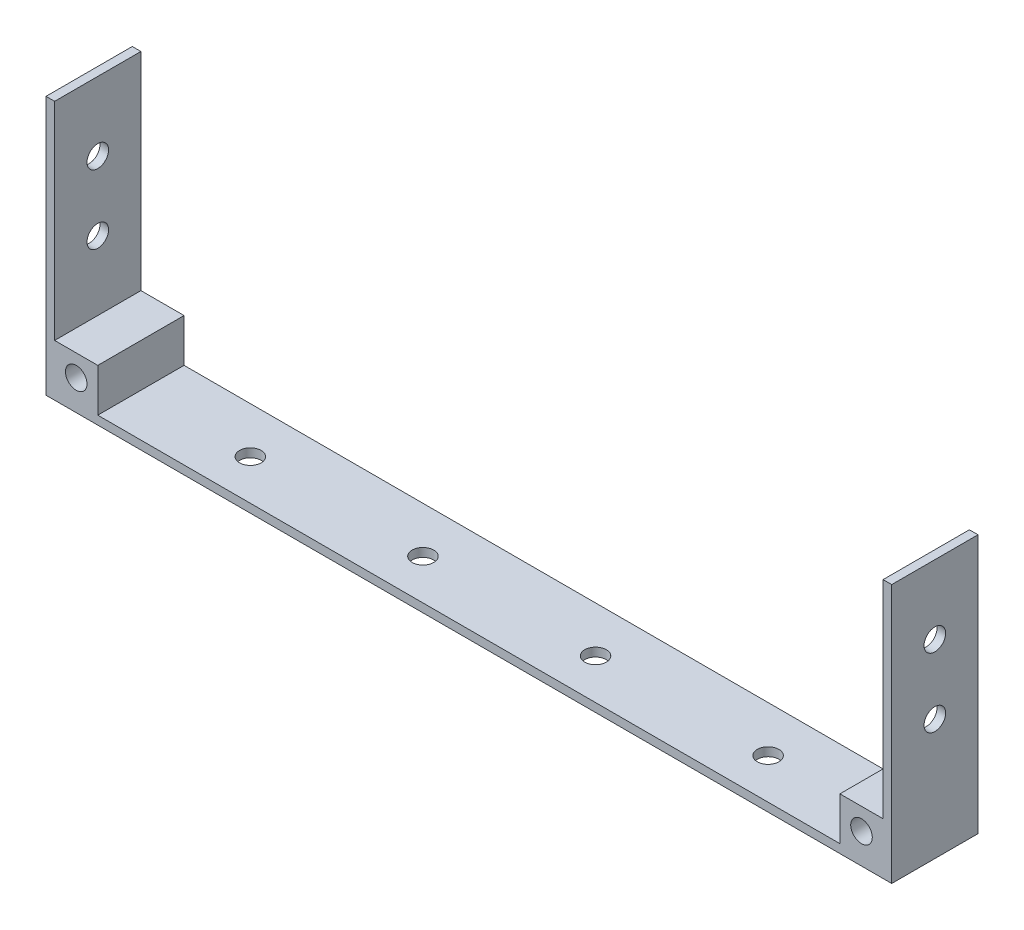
ISO-10303-21;
HEADER;
FILE_DESCRIPTION(('STEP AP214'),'2;1');
FILE_NAME('part.step','',(''),(''),'','','');
FILE_SCHEMA(('AUTOMOTIVE_DESIGN { 1 0 10303 214 1 1 1 1 }'));
ENDSEC;
DATA;
#1=APPLICATION_CONTEXT('core data for automotive mechanical design processes');
#2=APPLICATION_PROTOCOL_DEFINITION('international standard','automotive_design',2000,#1);
#3=PRODUCT_CONTEXT('',#1,'mechanical');
#4=PRODUCT('Part','Part','',(#3));
#5=PRODUCT_RELATED_PRODUCT_CATEGORY('part','',(#4));
#6=PRODUCT_DEFINITION_FORMATION('','',#4);
#7=PRODUCT_DEFINITION_CONTEXT('part definition',#1,'design');
#8=PRODUCT_DEFINITION('design','',#6,#7);
#9=PRODUCT_DEFINITION_SHAPE('','',#8);
#10=(LENGTH_UNIT() NAMED_UNIT(*) SI_UNIT(.MILLI.,.METRE.));
#11=(NAMED_UNIT(*) PLANE_ANGLE_UNIT() SI_UNIT($,.RADIAN.));
#12=(NAMED_UNIT(*) SI_UNIT($,.STERADIAN.) SOLID_ANGLE_UNIT());
#13=UNCERTAINTY_MEASURE_WITH_UNIT(LENGTH_MEASURE(1.E-05),#10,'distance_accuracy_value','');
#14=(GEOMETRIC_REPRESENTATION_CONTEXT(3) GLOBAL_UNCERTAINTY_ASSIGNED_CONTEXT((#13)) GLOBAL_UNIT_ASSIGNED_CONTEXT((#10,
#11,#12)) REPRESENTATION_CONTEXT('',''));
#15=CARTESIAN_POINT('',(0.,0.,0.));
#16=DIRECTION('',(0.,0.,1.));
#17=DIRECTION('',(1.,0.,0.));
#18=AXIS2_PLACEMENT_3D('',#15,#16,#17);
#19=CARTESIAN_POINT('',(246.38,0.,25.4));
#20=DIRECTION('',(-1.,0.,0.));
#21=DIRECTION('',(0.,0.,1.));
#22=AXIS2_PLACEMENT_3D('',#19,#20,#21);
#23=PLANE('',#22);
#24=CARTESIAN_POINT('',(246.38,55.88,12.7));
#25=DIRECTION('',(-1.,0.,0.));
#26=DIRECTION('',(0.,0.,1.));
#27=AXIS2_PLACEMENT_3D('',#24,#25,#26);
#28=CIRCLE('',#27,3.175);
#29=CARTESIAN_POINT('',(246.38,55.88,15.875));
#30=VERTEX_POINT('',#29);
#31=EDGE_CURVE('E279',#30,#30,#28,.T.);
#32=ORIENTED_EDGE('',*,*,#31,.F.);
#33=EDGE_LOOP('',(#32));
#34=FACE_BOUND('',#33,.T.);
#35=CARTESIAN_POINT('',(246.38,35.56,12.7));
#36=DIRECTION('',(-1.,0.,0.));
#37=DIRECTION('',(0.,0.,1.));
#38=AXIS2_PLACEMENT_3D('',#35,#36,#37);
#39=CIRCLE('',#38,3.175);
#40=CARTESIAN_POINT('',(246.38,35.56,15.875));
#41=VERTEX_POINT('',#40);
#42=EDGE_CURVE('E282',#41,#41,#39,.T.);
#43=ORIENTED_EDGE('',*,*,#42,.F.);
#44=EDGE_LOOP('',(#43));
#45=FACE_BOUND('',#44,.T.);
#46=DIRECTION('',(0.,1.,0.));
#47=VECTOR('',#46,1.);
#48=CARTESIAN_POINT('',(246.38,0.,0.));
#49=LINE('',#48,#47);
#50=CARTESIAN_POINT('',(246.38,15.24,0.));
#51=VERTEX_POINT('',#50);
#52=CARTESIAN_POINT('',(246.38,76.2,0.));
#53=VERTEX_POINT('',#52);
#54=EDGE_CURVE('E163',#51,#53,#49,.T.);
#55=ORIENTED_EDGE('',*,*,#54,.F.);
#56=DIRECTION('',(0.,0.,-1.));
#57=VECTOR('',#56,1.);
#58=CARTESIAN_POINT('',(246.38,15.24,25.4));
#59=LINE('',#58,#57);
#60=CARTESIAN_POINT('',(246.38,15.24,25.4));
#61=VERTEX_POINT('',#60);
#62=EDGE_CURVE('E11',#61,#51,#59,.T.);
#63=ORIENTED_EDGE('',*,*,#62,.F.);
#64=DIRECTION('',(0.,1.,0.));
#65=VECTOR('',#64,1.);
#66=CARTESIAN_POINT('',(246.38,0.,25.4));
#67=LINE('',#66,#65);
#68=CARTESIAN_POINT('',(246.38,76.2,25.4));
#69=VERTEX_POINT('',#68);
#70=EDGE_CURVE('E202',#61,#69,#67,.T.);
#71=ORIENTED_EDGE('',*,*,#70,.T.);
#72=DIRECTION('',(0.,0.,-1.));
#73=VECTOR('',#72,1.);
#74=CARTESIAN_POINT('',(246.38,76.2,25.4));
#75=LINE('',#74,#73);
#76=EDGE_CURVE('E54',#69,#53,#75,.T.);
#77=ORIENTED_EDGE('',*,*,#76,.T.);
#78=EDGE_LOOP('',(#55,#63,#71,#77));
#79=FACE_BOUND('',#78,.T.);
#80=ADVANCED_FACE('F38',(#34,#45,#79),#23,.T.);
#81=CARTESIAN_POINT('',(0.,15.24,25.4));
#82=DIRECTION('',(0.,-1.,0.));
#83=DIRECTION('',(1.,0.,0.));
#84=AXIS2_PLACEMENT_3D('',#81,#82,#83);
#85=PLANE('',#84);
#86=DIRECTION('',(-1.,0.,0.));
#87=VECTOR('',#86,1.);
#88=CARTESIAN_POINT('',(0.,15.24,0.));
#89=LINE('',#88,#87);
#90=CARTESIAN_POINT('',(233.68,15.24,0.));
#91=VERTEX_POINT('',#90);
#92=EDGE_CURVE('E165',#51,#91,#89,.T.);
#93=ORIENTED_EDGE('',*,*,#92,.T.);
#94=DIRECTION('',(0.,0.,-1.));
#95=VECTOR('',#94,1.);
#96=CARTESIAN_POINT('',(233.68,15.24,25.4));
#97=LINE('',#96,#95);
#98=CARTESIAN_POINT('',(233.68,15.24,25.4));
#99=VERTEX_POINT('',#98);
#100=EDGE_CURVE('E46',#99,#91,#97,.T.);
#101=ORIENTED_EDGE('',*,*,#100,.F.);
#102=DIRECTION('',(-1.,0.,0.));
#103=VECTOR('',#102,1.);
#104=CARTESIAN_POINT('',(0.,15.24,25.4));
#105=LINE('',#104,#103);
#106=EDGE_CURVE('E238',#61,#99,#105,.T.);
#107=ORIENTED_EDGE('',*,*,#106,.F.);
#108=ORIENTED_EDGE('',*,*,#62,.T.);
#109=EDGE_LOOP('',(#93,#101,#107,#108));
#110=FACE_BOUND('',#109,.T.);
#111=ADVANCED_FACE('F226',(#110),#85,.F.);
#112=CARTESIAN_POINT('',(233.68,0.,25.4));
#113=DIRECTION('',(-1.,0.,0.));
#114=DIRECTION('',(0.,0.,1.));
#115=AXIS2_PLACEMENT_3D('',#112,#113,#114);
#116=PLANE('',#115);
#117=DIRECTION('',(0.,1.,0.));
#118=VECTOR('',#117,1.);
#119=CARTESIAN_POINT('',(233.68,0.,0.));
#120=LINE('',#119,#118);
#121=CARTESIAN_POINT('',(233.68,2.54,0.));
#122=VERTEX_POINT('',#121);
#123=EDGE_CURVE('E169',#122,#91,#120,.T.);
#124=ORIENTED_EDGE('',*,*,#123,.F.);
#125=DIRECTION('',(0.,0.,-1.));
#126=VECTOR('',#125,1.);
#127=CARTESIAN_POINT('',(233.68,2.54,25.4));
#128=LINE('',#127,#126);
#129=CARTESIAN_POINT('',(233.68,2.54,25.4));
#130=VERTEX_POINT('',#129);
#131=EDGE_CURVE('E216',#130,#122,#128,.T.);
#132=ORIENTED_EDGE('',*,*,#131,.F.);
#133=DIRECTION('',(0.,1.,0.));
#134=VECTOR('',#133,1.);
#135=CARTESIAN_POINT('',(233.68,0.,25.4));
#136=LINE('',#135,#134);
#137=EDGE_CURVE('E223',#130,#99,#136,.T.);
#138=ORIENTED_EDGE('',*,*,#137,.T.);
#139=ORIENTED_EDGE('',*,*,#100,.T.);
#140=EDGE_LOOP('',(#124,#132,#138,#139));
#141=FACE_BOUND('',#140,.T.);
#142=ADVANCED_FACE('F221',(#141),#116,.T.);
#143=CARTESIAN_POINT('',(0.,2.54,25.4));
#144=DIRECTION('',(0.,1.,0.));
#145=DIRECTION('',(0.,0.,1.));
#146=AXIS2_PLACEMENT_3D('',#143,#144,#145);
#147=PLANE('',#146);
#148=CARTESIAN_POINT('',(200.66,2.54,13.5122344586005));
#149=DIRECTION('',(0.,1.,0.));
#150=DIRECTION('',(0.,0.,1.));
#151=AXIS2_PLACEMENT_3D('',#148,#149,#150);
#152=CIRCLE('',#151,3.175);
#153=CARTESIAN_POINT('',(200.66,2.54,16.6872344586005));
#154=VERTEX_POINT('',#153);
#155=EDGE_CURVE('E302',#154,#154,#152,.T.);
#156=ORIENTED_EDGE('',*,*,#155,.F.);
#157=EDGE_LOOP('',(#156));
#158=FACE_BOUND('',#157,.T.);
#159=CARTESIAN_POINT('',(48.26,2.54,13.5122344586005));
#160=DIRECTION('',(0.,1.,0.));
#161=DIRECTION('',(0.,0.,1.));
#162=AXIS2_PLACEMENT_3D('',#159,#160,#161);
#163=CIRCLE('',#162,3.175);
#164=CARTESIAN_POINT('',(48.26,2.54,16.6872344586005));
#165=VERTEX_POINT('',#164);
#166=EDGE_CURVE('E309',#165,#165,#163,.T.);
#167=ORIENTED_EDGE('',*,*,#166,.F.);
#168=EDGE_LOOP('',(#167));
#169=FACE_BOUND('',#168,.T.);
#170=CARTESIAN_POINT('',(99.06,2.54,13.5122344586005));
#171=DIRECTION('',(0.,1.,0.));
#172=DIRECTION('',(0.,0.,1.));
#173=AXIS2_PLACEMENT_3D('',#170,#171,#172);
#174=CIRCLE('',#173,3.175);
#175=CARTESIAN_POINT('',(99.06,2.54,16.6872344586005));
#176=VERTEX_POINT('',#175);
#177=EDGE_CURVE('E296',#176,#176,#174,.T.);
#178=ORIENTED_EDGE('',*,*,#177,.F.);
#179=EDGE_LOOP('',(#178));
#180=FACE_BOUND('',#179,.T.);
#181=CARTESIAN_POINT('',(149.86,2.54,13.5122344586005));
#182=DIRECTION('',(0.,1.,0.));
#183=DIRECTION('',(0.,0.,1.));
#184=AXIS2_PLACEMENT_3D('',#181,#182,#183);
#185=CIRCLE('',#184,3.17499999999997);
#186=CARTESIAN_POINT('',(149.86,2.54,16.6872344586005));
#187=VERTEX_POINT('',#186);
#188=EDGE_CURVE('E305',#187,#187,#185,.T.);
#189=ORIENTED_EDGE('',*,*,#188,.F.);
#190=EDGE_LOOP('',(#189));
#191=FACE_BOUND('',#190,.T.);
#192=DIRECTION('',(1.,0.,0.));
#193=VECTOR('',#192,1.);
#194=CARTESIAN_POINT('',(0.,2.54,0.));
#195=LINE('',#194,#193);
#196=CARTESIAN_POINT('',(15.24,2.54,0.));
#197=VERTEX_POINT('',#196);
#198=EDGE_CURVE('E172',#197,#122,#195,.T.);
#199=ORIENTED_EDGE('',*,*,#198,.F.);
#200=DIRECTION('',(0.,0.,-1.));
#201=VECTOR('',#200,1.);
#202=CARTESIAN_POINT('',(15.24,2.54,25.4));
#203=LINE('',#202,#201);
#204=CARTESIAN_POINT('',(15.24,2.54,25.4));
#205=VERTEX_POINT('',#204);
#206=EDGE_CURVE('E214',#205,#197,#203,.T.);
#207=ORIENTED_EDGE('',*,*,#206,.F.);
#208=DIRECTION('',(1.,0.,0.));
#209=VECTOR('',#208,1.);
#210=CARTESIAN_POINT('',(0.,2.54,25.4));
#211=LINE('',#210,#209);
#212=EDGE_CURVE('E237',#205,#130,#211,.T.);
#213=ORIENTED_EDGE('',*,*,#212,.T.);
#214=ORIENTED_EDGE('',*,*,#131,.T.);
#215=EDGE_LOOP('',(#199,#207,#213,#214));
#216=FACE_BOUND('',#215,.T.);
#217=ADVANCED_FACE('F233',(#158,#169,#180,#191,#216),#147,.T.);
#218=CARTESIAN_POINT('',(15.24,0.,25.4));
#219=DIRECTION('',(-1.,0.,0.));
#220=DIRECTION('',(0.,-1.,0.));
#221=AXIS2_PLACEMENT_3D('',#218,#219,#220);
#222=PLANE('',#221);
#223=DIRECTION('',(0.,1.,0.));
#224=VECTOR('',#223,1.);
#225=CARTESIAN_POINT('',(15.24,0.,0.));
#226=LINE('',#225,#224);
#227=CARTESIAN_POINT('',(15.24,15.24,0.));
#228=VERTEX_POINT('',#227);
#229=EDGE_CURVE('E175',#197,#228,#226,.T.);
#230=ORIENTED_EDGE('',*,*,#229,.T.);
#231=DIRECTION('',(0.,0.,-1.));
#232=VECTOR('',#231,1.);
#233=CARTESIAN_POINT('',(15.24,15.24,25.4));
#234=LINE('',#233,#232);
#235=CARTESIAN_POINT('',(15.24,15.24,25.4));
#236=VERTEX_POINT('',#235);
#237=EDGE_CURVE('E212',#236,#228,#234,.T.);
#238=ORIENTED_EDGE('',*,*,#237,.F.);
#239=DIRECTION('',(0.,1.,0.));
#240=VECTOR('',#239,1.);
#241=CARTESIAN_POINT('',(15.24,0.,25.4));
#242=LINE('',#241,#240);
#243=EDGE_CURVE('E240',#205,#236,#242,.T.);
#244=ORIENTED_EDGE('',*,*,#243,.F.);
#245=ORIENTED_EDGE('',*,*,#206,.T.);
#246=EDGE_LOOP('',(#230,#238,#244,#245));
#247=FACE_BOUND('',#246,.T.);
#248=ADVANCED_FACE('F322',(#247),#222,.F.);
#249=CARTESIAN_POINT('',(0.,15.24,25.4));
#250=DIRECTION('',(0.,1.,0.));
#251=DIRECTION('',(0.,0.,1.));
#252=AXIS2_PLACEMENT_3D('',#249,#250,#251);
#253=PLANE('',#252);
#254=DIRECTION('',(1.,0.,0.));
#255=VECTOR('',#254,1.);
#256=CARTESIAN_POINT('',(0.,15.24,0.));
#257=LINE('',#256,#255);
#258=CARTESIAN_POINT('',(2.54,15.24,0.));
#259=VERTEX_POINT('',#258);
#260=EDGE_CURVE('E178',#259,#228,#257,.T.);
#261=ORIENTED_EDGE('',*,*,#260,.F.);
#262=DIRECTION('',(0.,0.,-1.));
#263=VECTOR('',#262,1.);
#264=CARTESIAN_POINT('',(2.54,15.24,25.4));
#265=LINE('',#264,#263);
#266=CARTESIAN_POINT('',(2.54,15.24,25.4));
#267=VERTEX_POINT('',#266);
#268=EDGE_CURVE('E210',#267,#259,#265,.T.);
#269=ORIENTED_EDGE('',*,*,#268,.F.);
#270=DIRECTION('',(1.,0.,0.));
#271=VECTOR('',#270,1.);
#272=CARTESIAN_POINT('',(0.,15.24,25.4));
#273=LINE('',#272,#271);
#274=EDGE_CURVE('E246',#267,#236,#273,.T.);
#275=ORIENTED_EDGE('',*,*,#274,.T.);
#276=ORIENTED_EDGE('',*,*,#237,.T.);
#277=EDGE_LOOP('',(#261,#269,#275,#276));
#278=FACE_BOUND('',#277,.T.);
#279=ADVANCED_FACE('F329',(#278),#253,.T.);
#280=CARTESIAN_POINT('',(2.54,0.,25.4));
#281=DIRECTION('',(-1.,0.,0.));
#282=DIRECTION('',(0.,0.,1.));
#283=AXIS2_PLACEMENT_3D('',#280,#281,#282);
#284=PLANE('',#283);
#285=CARTESIAN_POINT('',(2.54,55.88,12.7));
#286=DIRECTION('',(-1.,0.,0.));
#287=DIRECTION('',(0.,0.,1.));
#288=AXIS2_PLACEMENT_3D('',#285,#286,#287);
#289=CIRCLE('',#288,3.175);
#290=CARTESIAN_POINT('',(2.54,55.88,15.875));
#291=VERTEX_POINT('',#290);
#292=EDGE_CURVE('E284',#291,#291,#289,.T.);
#293=ORIENTED_EDGE('',*,*,#292,.T.);
#294=EDGE_LOOP('',(#293));
#295=FACE_BOUND('',#294,.T.);
#296=CARTESIAN_POINT('',(2.54,35.56,12.7));
#297=DIRECTION('',(-1.,0.,0.));
#298=DIRECTION('',(0.,0.,1.));
#299=AXIS2_PLACEMENT_3D('',#296,#297,#298);
#300=CIRCLE('',#299,3.175);
#301=CARTESIAN_POINT('',(2.54,35.56,15.875));
#302=VERTEX_POINT('',#301);
#303=EDGE_CURVE('E285',#302,#302,#300,.T.);
#304=ORIENTED_EDGE('',*,*,#303,.T.);
#305=EDGE_LOOP('',(#304));
#306=FACE_BOUND('',#305,.T.);
#307=DIRECTION('',(0.,1.,0.));
#308=VECTOR('',#307,1.);
#309=CARTESIAN_POINT('',(2.54,0.,0.));
#310=LINE('',#309,#308);
#311=CARTESIAN_POINT('',(2.54,76.2,0.));
#312=VERTEX_POINT('',#311);
#313=EDGE_CURVE('E181',#259,#312,#310,.T.);
#314=ORIENTED_EDGE('',*,*,#313,.T.);
#315=DIRECTION('',(0.,0.,-1.));
#316=VECTOR('',#315,1.);
#317=CARTESIAN_POINT('',(2.54,76.2,25.4));
#318=LINE('',#317,#316);
#319=CARTESIAN_POINT('',(2.54,76.2,25.4));
#320=VERTEX_POINT('',#319);
#321=EDGE_CURVE('E208',#320,#312,#318,.T.);
#322=ORIENTED_EDGE('',*,*,#321,.F.);
#323=DIRECTION('',(0.,1.,0.));
#324=VECTOR('',#323,1.);
#325=CARTESIAN_POINT('',(2.54,0.,25.4));
#326=LINE('',#325,#324);
#327=EDGE_CURVE('E249',#267,#320,#326,.T.);
#328=ORIENTED_EDGE('',*,*,#327,.F.);
#329=ORIENTED_EDGE('',*,*,#268,.T.);
#330=EDGE_LOOP('',(#314,#322,#328,#329));
#331=FACE_BOUND('',#330,.T.);
#332=ADVANCED_FACE('F338',(#295,#306,#331),#284,.F.);
#333=CARTESIAN_POINT('',(0.,76.2,25.4));
#334=DIRECTION('',(0.,1.,0.));
#335=DIRECTION('',(0.,0.,1.));
#336=AXIS2_PLACEMENT_3D('',#333,#334,#335);
#337=PLANE('',#336);
#338=DIRECTION('',(1.,0.,0.));
#339=VECTOR('',#338,1.);
#340=CARTESIAN_POINT('',(0.,76.2,0.));
#341=LINE('',#340,#339);
#342=CARTESIAN_POINT('',(0.,76.2,0.));
#343=VERTEX_POINT('',#342);
#344=EDGE_CURVE('E184',#343,#312,#341,.T.);
#345=ORIENTED_EDGE('',*,*,#344,.F.);
#346=DIRECTION('',(0.,0.,-1.));
#347=VECTOR('',#346,1.);
#348=CARTESIAN_POINT('',(0.,76.2,25.4));
#349=LINE('',#348,#347);
#350=CARTESIAN_POINT('',(0.,76.2,25.4));
#351=VERTEX_POINT('',#350);
#352=EDGE_CURVE('E206',#351,#343,#349,.T.);
#353=ORIENTED_EDGE('',*,*,#352,.F.);
#354=DIRECTION('',(1.,0.,0.));
#355=VECTOR('',#354,1.);
#356=CARTESIAN_POINT('',(0.,76.2,25.4));
#357=LINE('',#356,#355);
#358=EDGE_CURVE('E251',#351,#320,#357,.T.);
#359=ORIENTED_EDGE('',*,*,#358,.T.);
#360=ORIENTED_EDGE('',*,*,#321,.T.);
#361=EDGE_LOOP('',(#345,#353,#359,#360));
#362=FACE_BOUND('',#361,.T.);
#363=ADVANCED_FACE('F342',(#362),#337,.T.);
#364=CARTESIAN_POINT('',(0.,0.,25.4));
#365=DIRECTION('',(-1.,0.,0.));
#366=DIRECTION('',(0.,0.,1.));
#367=AXIS2_PLACEMENT_3D('',#364,#365,#366);
#368=PLANE('',#367);
#369=CARTESIAN_POINT('',(0.,55.88,12.7));
#370=DIRECTION('',(1.,0.,0.));
#371=DIRECTION('',(0.,0.,-1.));
#372=AXIS2_PLACEMENT_3D('',#369,#370,#371);
#373=CIRCLE('',#372,3.175);
#374=CARTESIAN_POINT('',(0.,55.88,9.525));
#375=VERTEX_POINT('',#374);
#376=EDGE_CURVE('E290',#375,#375,#373,.T.);
#377=ORIENTED_EDGE('',*,*,#376,.T.);
#378=EDGE_LOOP('',(#377));
#379=FACE_BOUND('',#378,.T.);
#380=CARTESIAN_POINT('',(0.,35.56,12.7));
#381=DIRECTION('',(1.,0.,0.));
#382=DIRECTION('',(0.,0.,-1.));
#383=AXIS2_PLACEMENT_3D('',#380,#381,#382);
#384=CIRCLE('',#383,3.175);
#385=CARTESIAN_POINT('',(0.,35.56,9.525));
#386=VERTEX_POINT('',#385);
#387=EDGE_CURVE('E364',#386,#386,#384,.T.);
#388=ORIENTED_EDGE('',*,*,#387,.T.);
#389=EDGE_LOOP('',(#388));
#390=FACE_BOUND('',#389,.T.);
#391=DIRECTION('',(0.,1.,0.));
#392=VECTOR('',#391,1.);
#393=CARTESIAN_POINT('',(0.,0.,0.));
#394=LINE('',#393,#392);
#395=CARTESIAN_POINT('',(0.,0.,0.));
#396=VERTEX_POINT('',#395);
#397=EDGE_CURVE('E187',#396,#343,#394,.T.);
#398=ORIENTED_EDGE('',*,*,#397,.F.);
#399=DIRECTION('',(0.,0.,-1.));
#400=VECTOR('',#399,1.);
#401=CARTESIAN_POINT('',(0.,0.,25.4));
#402=LINE('',#401,#400);
#403=CARTESIAN_POINT('',(0.,0.,25.4));
#404=VERTEX_POINT('',#403);
#405=EDGE_CURVE('E149',#404,#396,#402,.T.);
#406=ORIENTED_EDGE('',*,*,#405,.F.);
#407=DIRECTION('',(0.,1.,0.));
#408=VECTOR('',#407,1.);
#409=CARTESIAN_POINT('',(0.,0.,25.4));
#410=LINE('',#409,#408);
#411=EDGE_CURVE('E139',#404,#351,#410,.T.);
#412=ORIENTED_EDGE('',*,*,#411,.T.);
#413=ORIENTED_EDGE('',*,*,#352,.T.);
#414=EDGE_LOOP('',(#398,#406,#412,#413));
#415=FACE_BOUND('',#414,.T.);
#416=ADVANCED_FACE('F255',(#379,#390,#415),#368,.T.);
#417=CARTESIAN_POINT('',(0.,0.,25.4));
#418=DIRECTION('',(0.,1.,0.));
#419=DIRECTION('',(0.,0.,1.));
#420=AXIS2_PLACEMENT_3D('',#417,#418,#419);
#421=PLANE('',#420);
#422=CARTESIAN_POINT('',(200.66,0.,13.5122344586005));
#423=DIRECTION('',(0.,1.,0.));
#424=DIRECTION('',(0.,0.,1.));
#425=AXIS2_PLACEMENT_3D('',#422,#423,#424);
#426=CIRCLE('',#425,3.175);
#427=CARTESIAN_POINT('',(200.66,0.,16.6872344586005));
#428=VERTEX_POINT('',#427);
#429=EDGE_CURVE('E306',#428,#428,#426,.T.);
#430=ORIENTED_EDGE('',*,*,#429,.T.);
#431=EDGE_LOOP('',(#430));
#432=FACE_BOUND('',#431,.T.);
#433=CARTESIAN_POINT('',(48.26,0.,13.5122344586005));
#434=DIRECTION('',(0.,1.,0.));
#435=DIRECTION('',(0.,0.,1.));
#436=AXIS2_PLACEMENT_3D('',#433,#434,#435);
#437=CIRCLE('',#436,3.175);
#438=CARTESIAN_POINT('',(48.26,0.,16.6872344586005));
#439=VERTEX_POINT('',#438);
#440=EDGE_CURVE('E299',#439,#439,#437,.T.);
#441=ORIENTED_EDGE('',*,*,#440,.T.);
#442=EDGE_LOOP('',(#441));
#443=FACE_BOUND('',#442,.T.);
#444=CARTESIAN_POINT('',(99.06,0.,13.5122344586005));
#445=DIRECTION('',(0.,1.,0.));
#446=DIRECTION('',(0.,0.,1.));
#447=AXIS2_PLACEMENT_3D('',#444,#445,#446);
#448=CIRCLE('',#447,3.175);
#449=CARTESIAN_POINT('',(99.06,0.,16.6872344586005));
#450=VERTEX_POINT('',#449);
#451=EDGE_CURVE('E295',#450,#450,#448,.T.);
#452=ORIENTED_EDGE('',*,*,#451,.T.);
#453=EDGE_LOOP('',(#452));
#454=FACE_BOUND('',#453,.T.);
#455=CARTESIAN_POINT('',(149.86,0.,13.5122344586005));
#456=DIRECTION('',(0.,1.,0.));
#457=DIRECTION('',(0.,0.,1.));
#458=AXIS2_PLACEMENT_3D('',#455,#456,#457);
#459=CIRCLE('',#458,3.17499999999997);
#460=CARTESIAN_POINT('',(149.86,0.,16.6872344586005));
#461=VERTEX_POINT('',#460);
#462=EDGE_CURVE('E166',#461,#461,#459,.T.);
#463=ORIENTED_EDGE('',*,*,#462,.T.);
#464=EDGE_LOOP('',(#463));
#465=FACE_BOUND('',#464,.T.);
#466=DIRECTION('',(1.,0.,0.));
#467=VECTOR('',#466,1.);
#468=CARTESIAN_POINT('',(0.,0.,0.));
#469=LINE('',#468,#467);
#470=CARTESIAN_POINT('',(248.92,0.,0.));
#471=VERTEX_POINT('',#470);
#472=EDGE_CURVE('E146',#396,#471,#469,.T.);
#473=ORIENTED_EDGE('',*,*,#472,.T.);
#474=DIRECTION('',(0.,0.,-1.));
#475=VECTOR('',#474,1.);
#476=CARTESIAN_POINT('',(248.92,0.,25.4));
#477=LINE('',#476,#475);
#478=CARTESIAN_POINT('',(248.92,0.,25.4));
#479=VERTEX_POINT('',#478);
#480=EDGE_CURVE('E143',#479,#471,#477,.T.);
#481=ORIENTED_EDGE('',*,*,#480,.F.);
#482=DIRECTION('',(1.,0.,0.));
#483=VECTOR('',#482,1.);
#484=CARTESIAN_POINT('',(0.,0.,25.4));
#485=LINE('',#484,#483);
#486=EDGE_CURVE('E129',#404,#479,#485,.T.);
#487=ORIENTED_EDGE('',*,*,#486,.F.);
#488=ORIENTED_EDGE('',*,*,#405,.T.);
#489=EDGE_LOOP('',(#473,#481,#487,#488));
#490=FACE_BOUND('',#489,.T.);
#491=ADVANCED_FACE('F144',(#432,#443,#454,#465,#490),#421,.F.);
#492=CARTESIAN_POINT('',(248.92,0.,25.4));
#493=DIRECTION('',(-1.,0.,0.));
#494=DIRECTION('',(0.,0.,1.));
#495=AXIS2_PLACEMENT_3D('',#492,#493,#494);
#496=PLANE('',#495);
#497=CARTESIAN_POINT('',(248.92,55.88,12.7));
#498=DIRECTION('',(1.,0.,0.));
#499=DIRECTION('',(0.,0.,-1.));
#500=AXIS2_PLACEMENT_3D('',#497,#498,#499);
#501=CIRCLE('',#500,3.175);
#502=CARTESIAN_POINT('',(248.92,55.88,9.525));
#503=VERTEX_POINT('',#502);
#504=EDGE_CURVE('E359',#503,#503,#501,.T.);
#505=ORIENTED_EDGE('',*,*,#504,.F.);
#506=EDGE_LOOP('',(#505));
#507=FACE_BOUND('',#506,.T.);
#508=CARTESIAN_POINT('',(248.92,35.56,12.7));
#509=DIRECTION('',(1.,0.,0.));
#510=DIRECTION('',(0.,0.,-1.));
#511=AXIS2_PLACEMENT_3D('',#508,#509,#510);
#512=CIRCLE('',#511,3.175);
#513=CARTESIAN_POINT('',(248.92,35.56,9.525));
#514=VERTEX_POINT('',#513);
#515=EDGE_CURVE('E362',#514,#514,#512,.T.);
#516=ORIENTED_EDGE('',*,*,#515,.F.);
#517=EDGE_LOOP('',(#516));
#518=FACE_BOUND('',#517,.T.);
#519=DIRECTION('',(0.,1.,0.));
#520=VECTOR('',#519,1.);
#521=CARTESIAN_POINT('',(248.92,0.,0.));
#522=LINE('',#521,#520);
#523=CARTESIAN_POINT('',(248.92,76.2,0.));
#524=VERTEX_POINT('',#523);
#525=EDGE_CURVE('E191',#471,#524,#522,.T.);
#526=ORIENTED_EDGE('',*,*,#525,.T.);
#527=DIRECTION('',(0.,0.,-1.));
#528=VECTOR('',#527,1.);
#529=CARTESIAN_POINT('',(248.92,76.2,25.4));
#530=LINE('',#529,#528);
#531=CARTESIAN_POINT('',(248.92,76.2,25.4));
#532=VERTEX_POINT('',#531);
#533=EDGE_CURVE('E92',#532,#524,#530,.T.);
#534=ORIENTED_EDGE('',*,*,#533,.F.);
#535=DIRECTION('',(0.,1.,0.));
#536=VECTOR('',#535,1.);
#537=CARTESIAN_POINT('',(248.92,0.,25.4));
#538=LINE('',#537,#536);
#539=EDGE_CURVE('E136',#479,#532,#538,.T.);
#540=ORIENTED_EDGE('',*,*,#539,.F.);
#541=ORIENTED_EDGE('',*,*,#480,.T.);
#542=EDGE_LOOP('',(#526,#534,#540,#541));
#543=FACE_BOUND('',#542,.T.);
#544=ADVANCED_FACE('F151',(#507,#518,#543),#496,.F.);
#545=CARTESIAN_POINT('',(8.89,8.89,25.4));
#546=DIRECTION('',(0.,0.,-1.));
#547=DIRECTION('',(-1.,0.,0.));
#548=AXIS2_PLACEMENT_3D('',#545,#546,#547);
#549=CYLINDRICAL_SURFACE('',#548,3.175);
#550=CARTESIAN_POINT('',(8.89,8.89,25.4));
#551=DIRECTION('',(0.,0.,1.));
#552=DIRECTION('',(1.,0.,0.));
#553=AXIS2_PLACEMENT_3D('',#550,#551,#552);
#554=CIRCLE('',#553,3.175);
#555=CARTESIAN_POINT('',(12.065,8.89,25.4));
#556=VERTEX_POINT('',#555);
#557=EDGE_CURVE('E154',#556,#556,#554,.T.);
#558=ORIENTED_EDGE('',*,*,#557,.T.);
#559=EDGE_LOOP('',(#558));
#560=FACE_BOUND('',#559,.T.);
#561=CARTESIAN_POINT('',(8.89,8.89,0.));
#562=DIRECTION('',(0.,0.,1.));
#563=DIRECTION('',(1.,0.,0.));
#564=AXIS2_PLACEMENT_3D('',#561,#562,#563);
#565=CIRCLE('',#564,3.175);
#566=CARTESIAN_POINT('',(12.065,8.89,0.));
#567=VERTEX_POINT('',#566);
#568=EDGE_CURVE('E196',#567,#567,#565,.T.);
#569=ORIENTED_EDGE('',*,*,#568,.F.);
#570=EDGE_LOOP('',(#569));
#571=FACE_BOUND('',#570,.T.);
#572=ADVANCED_FACE('F260',(#560,#571),#549,.F.);
#573=CARTESIAN_POINT('',(0.,76.2,25.4));
#574=DIRECTION('',(0.,1.,0.));
#575=DIRECTION('',(0.,0.,1.));
#576=AXIS2_PLACEMENT_3D('',#573,#574,#575);
#577=PLANE('',#576);
#578=DIRECTION('',(1.,0.,0.));
#579=VECTOR('',#578,1.);
#580=CARTESIAN_POINT('',(0.,76.2,0.));
#581=LINE('',#580,#579);
#582=EDGE_CURVE('E193',#53,#524,#581,.T.);
#583=ORIENTED_EDGE('',*,*,#582,.F.);
#584=ORIENTED_EDGE('',*,*,#76,.F.);
#585=DIRECTION('',(1.,0.,0.));
#586=VECTOR('',#585,1.);
#587=CARTESIAN_POINT('',(0.,76.2,25.4));
#588=LINE('',#587,#586);
#589=EDGE_CURVE('E152',#69,#532,#588,.T.);
#590=ORIENTED_EDGE('',*,*,#589,.T.);
#591=ORIENTED_EDGE('',*,*,#533,.T.);
#592=EDGE_LOOP('',(#583,#584,#590,#591));
#593=FACE_BOUND('',#592,.T.);
#594=ADVANCED_FACE('F257',(#593),#577,.T.);
#595=CARTESIAN_POINT('',(240.03,8.89,25.4));
#596=DIRECTION('',(0.,0.,-1.));
#597=DIRECTION('',(-1.,0.,0.));
#598=AXIS2_PLACEMENT_3D('',#595,#596,#597);
#599=CYLINDRICAL_SURFACE('',#598,3.175);
#600=CARTESIAN_POINT('',(240.03,8.89,25.4));
#601=DIRECTION('',(0.,0.,1.));
#602=DIRECTION('',(1.,0.,0.));
#603=AXIS2_PLACEMENT_3D('',#600,#601,#602);
#604=CIRCLE('',#603,3.175);
#605=CARTESIAN_POINT('',(243.205,8.89,25.4));
#606=VERTEX_POINT('',#605);
#607=EDGE_CURVE('E160',#606,#606,#604,.T.);
#608=ORIENTED_EDGE('',*,*,#607,.T.);
#609=EDGE_LOOP('',(#608));
#610=FACE_BOUND('',#609,.T.);
#611=CARTESIAN_POINT('',(240.03,8.89,0.));
#612=DIRECTION('',(0.,0.,1.));
#613=DIRECTION('',(1.,0.,0.));
#614=AXIS2_PLACEMENT_3D('',#611,#612,#613);
#615=CIRCLE('',#614,3.175);
#616=CARTESIAN_POINT('',(243.205,8.89,0.));
#617=VERTEX_POINT('',#616);
#618=EDGE_CURVE('E199',#617,#617,#615,.T.);
#619=ORIENTED_EDGE('',*,*,#618,.F.);
#620=EDGE_LOOP('',(#619));
#621=FACE_BOUND('',#620,.T.);
#622=ADVANCED_FACE('F259',(#610,#621),#599,.F.);
#623=CARTESIAN_POINT('',(0.,0.,25.4));
#624=DIRECTION('',(0.,0.,1.));
#625=DIRECTION('',(1.,0.,0.));
#626=AXIS2_PLACEMENT_3D('',#623,#624,#625);
#627=PLANE('',#626);
#628=ORIENTED_EDGE('',*,*,#70,.F.);
#629=ORIENTED_EDGE('',*,*,#106,.T.);
#630=ORIENTED_EDGE('',*,*,#137,.F.);
#631=ORIENTED_EDGE('',*,*,#212,.F.);
#632=ORIENTED_EDGE('',*,*,#243,.T.);
#633=ORIENTED_EDGE('',*,*,#274,.F.);
#634=ORIENTED_EDGE('',*,*,#327,.T.);
#635=ORIENTED_EDGE('',*,*,#358,.F.);
#636=ORIENTED_EDGE('',*,*,#411,.F.);
#637=ORIENTED_EDGE('',*,*,#486,.T.);
#638=ORIENTED_EDGE('',*,*,#539,.T.);
#639=ORIENTED_EDGE('',*,*,#589,.F.);
#640=EDGE_LOOP('',(#628,#629,#630,#631,#632,#633,#634,#635,#636,#637,#638,#639));
#641=FACE_BOUND('',#640,.T.);
#642=ORIENTED_EDGE('',*,*,#557,.F.);
#643=EDGE_LOOP('',(#642));
#644=FACE_BOUND('',#643,.T.);
#645=ORIENTED_EDGE('',*,*,#607,.F.);
#646=EDGE_LOOP('',(#645));
#647=FACE_BOUND('',#646,.T.);
#648=ADVANCED_FACE('F132',(#641,#644,#647),#627,.T.);
#649=CARTESIAN_POINT('',(0.,0.,0.));
#650=DIRECTION('',(0.,0.,1.));
#651=DIRECTION('',(1.,0.,0.));
#652=AXIS2_PLACEMENT_3D('',#649,#650,#651);
#653=PLANE('',#652);
#654=ORIENTED_EDGE('',*,*,#54,.T.);
#655=ORIENTED_EDGE('',*,*,#582,.T.);
#656=ORIENTED_EDGE('',*,*,#525,.F.);
#657=ORIENTED_EDGE('',*,*,#472,.F.);
#658=ORIENTED_EDGE('',*,*,#397,.T.);
#659=ORIENTED_EDGE('',*,*,#344,.T.);
#660=ORIENTED_EDGE('',*,*,#313,.F.);
#661=ORIENTED_EDGE('',*,*,#260,.T.);
#662=ORIENTED_EDGE('',*,*,#229,.F.);
#663=ORIENTED_EDGE('',*,*,#198,.T.);
#664=ORIENTED_EDGE('',*,*,#123,.T.);
#665=ORIENTED_EDGE('',*,*,#92,.F.);
#666=EDGE_LOOP('',(#654,#655,#656,#657,#658,#659,#660,#661,#662,#663,#664,#665));
#667=FACE_BOUND('',#666,.T.);
#668=ORIENTED_EDGE('',*,*,#568,.T.);
#669=EDGE_LOOP('',(#668));
#670=FACE_BOUND('',#669,.T.);
#671=ORIENTED_EDGE('',*,*,#618,.T.);
#672=EDGE_LOOP('',(#671));
#673=FACE_BOUND('',#672,.T.);
#674=ADVANCED_FACE('F228',(#667,#670,#673),#653,.F.);
#675=CARTESIAN_POINT('',(149.86,0.,13.5122344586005));
#676=DIRECTION('',(0.,1.,0.));
#677=DIRECTION('',(0.,0.,1.));
#678=AXIS2_PLACEMENT_3D('',#675,#676,#677);
#679=CYLINDRICAL_SURFACE('',#678,3.17499999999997);
#680=ORIENTED_EDGE('',*,*,#462,.F.);
#681=EDGE_LOOP('',(#680));
#682=FACE_BOUND('',#681,.T.);
#683=ORIENTED_EDGE('',*,*,#188,.T.);
#684=EDGE_LOOP('',(#683));
#685=FACE_BOUND('',#684,.T.);
#686=ADVANCED_FACE('F319',(#682,#685),#679,.F.);
#687=CARTESIAN_POINT('',(99.06,0.,13.5122344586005));
#688=DIRECTION('',(0.,1.,0.));
#689=DIRECTION('',(0.,0.,1.));
#690=AXIS2_PLACEMENT_3D('',#687,#688,#689);
#691=CYLINDRICAL_SURFACE('',#690,3.175);
#692=ORIENTED_EDGE('',*,*,#451,.F.);
#693=EDGE_LOOP('',(#692));
#694=FACE_BOUND('',#693,.T.);
#695=ORIENTED_EDGE('',*,*,#177,.T.);
#696=EDGE_LOOP('',(#695));
#697=FACE_BOUND('',#696,.T.);
#698=ADVANCED_FACE('F411',(#694,#697),#691,.F.);
#699=CARTESIAN_POINT('',(48.26,0.,13.5122344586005));
#700=DIRECTION('',(0.,1.,0.));
#701=DIRECTION('',(0.,0.,1.));
#702=AXIS2_PLACEMENT_3D('',#699,#700,#701);
#703=CYLINDRICAL_SURFACE('',#702,3.175);
#704=ORIENTED_EDGE('',*,*,#440,.F.);
#705=EDGE_LOOP('',(#704));
#706=FACE_BOUND('',#705,.T.);
#707=ORIENTED_EDGE('',*,*,#166,.T.);
#708=EDGE_LOOP('',(#707));
#709=FACE_BOUND('',#708,.T.);
#710=ADVANCED_FACE('F405',(#706,#709),#703,.F.);
#711=CARTESIAN_POINT('',(200.66,0.,13.5122344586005));
#712=DIRECTION('',(0.,1.,0.));
#713=DIRECTION('',(0.,0.,1.));
#714=AXIS2_PLACEMENT_3D('',#711,#712,#713);
#715=CYLINDRICAL_SURFACE('',#714,3.175);
#716=ORIENTED_EDGE('',*,*,#429,.F.);
#717=EDGE_LOOP('',(#716));
#718=FACE_BOUND('',#717,.T.);
#719=ORIENTED_EDGE('',*,*,#155,.T.);
#720=EDGE_LOOP('',(#719));
#721=FACE_BOUND('',#720,.T.);
#722=ADVANCED_FACE('F401',(#718,#721),#715,.F.);
#723=CARTESIAN_POINT('',(0.,35.56,12.7));
#724=DIRECTION('',(1.,0.,0.));
#725=DIRECTION('',(0.,0.,-1.));
#726=AXIS2_PLACEMENT_3D('',#723,#724,#725);
#727=CYLINDRICAL_SURFACE('',#726,3.175);
#728=ORIENTED_EDGE('',*,*,#42,.T.);
#729=EDGE_LOOP('',(#728));
#730=FACE_BOUND('',#729,.T.);
#731=ORIENTED_EDGE('',*,*,#515,.T.);
#732=EDGE_LOOP('',(#731));
#733=FACE_BOUND('',#732,.T.);
#734=ADVANCED_FACE('F393',(#730,#733),#727,.F.);
#735=CARTESIAN_POINT('',(0.,55.88,12.7));
#736=DIRECTION('',(1.,0.,0.));
#737=DIRECTION('',(0.,0.,-1.));
#738=AXIS2_PLACEMENT_3D('',#735,#736,#737);
#739=CYLINDRICAL_SURFACE('',#738,3.175);
#740=ORIENTED_EDGE('',*,*,#31,.T.);
#741=EDGE_LOOP('',(#740));
#742=FACE_BOUND('',#741,.T.);
#743=ORIENTED_EDGE('',*,*,#504,.T.);
#744=EDGE_LOOP('',(#743));
#745=FACE_BOUND('',#744,.T.);
#746=ADVANCED_FACE('F378',(#742,#745),#739,.F.);
#747=ORIENTED_EDGE('',*,*,#387,.F.);
#748=EDGE_LOOP('',(#747));
#749=FACE_BOUND('',#748,.T.);
#750=ORIENTED_EDGE('',*,*,#303,.F.);
#751=EDGE_LOOP('',(#750));
#752=FACE_BOUND('',#751,.T.);
#753=ADVANCED_FACE('F376',(#749,#752),#727,.F.);
#754=ORIENTED_EDGE('',*,*,#376,.F.);
#755=EDGE_LOOP('',(#754));
#756=FACE_BOUND('',#755,.T.);
#757=ORIENTED_EDGE('',*,*,#292,.F.);
#758=EDGE_LOOP('',(#757));
#759=FACE_BOUND('',#758,.T.);
#760=ADVANCED_FACE('F373',(#756,#759),#739,.F.);
#761=CLOSED_SHELL('',(#80,#111,#142,#217,#248,#279,#332,#363,#416,#491,#544,#572,#594,#622,#648,
#674,#686,#698,#710,#722,#734,#746,#753,#760));
#762=MANIFOLD_SOLID_BREP('B2',#761);
#763=ADVANCED_BREP_SHAPE_REPRESENTATION('',(#18,#762),#14);
#764=SHAPE_DEFINITION_REPRESENTATION(#9,#763);
ENDSEC;
END-ISO-10303-21;
